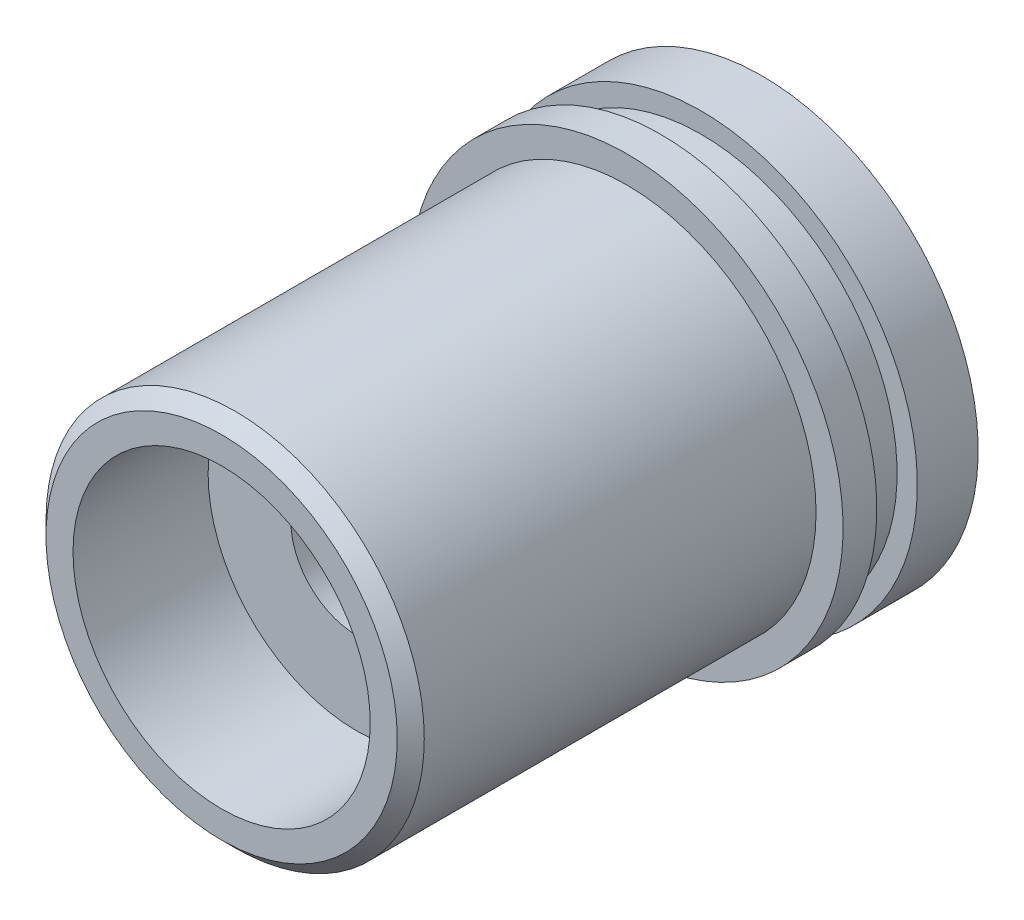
from build123d import *

# Parameters (mm, degrees)
CHANF_1_SIZE = 1


with BuildPart() as part:
    # Esquisse1 → Bague d15 (revolve)
    with BuildSketch(Plane(origin=(0, 0, 0), x_dir=(1, 0, 0), z_dir=(0, 1, 0))):
        Polygon((-7.5, 10), (-16, 10), (-16, 5.5), (-14.5, 5.5), (-14.5, 2.5), (-16, 2.5), (-16, 0), (-14, 0), (-14, -30), (-11, -30), (-11, -20), (-4.875340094, -20), align=None)
    revolve(axis=Axis((0, 0, -11.087301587), (0, 0, 1)))

    # Chanf 1
    chanf_1_edges = [part.edges().sort_by_distance(p)[0] for p in [
        (14, 0, 30),
    ]]
    chamfer(chanf_1_edges, length=CHANF_1_SIZE)


solid = part.part
